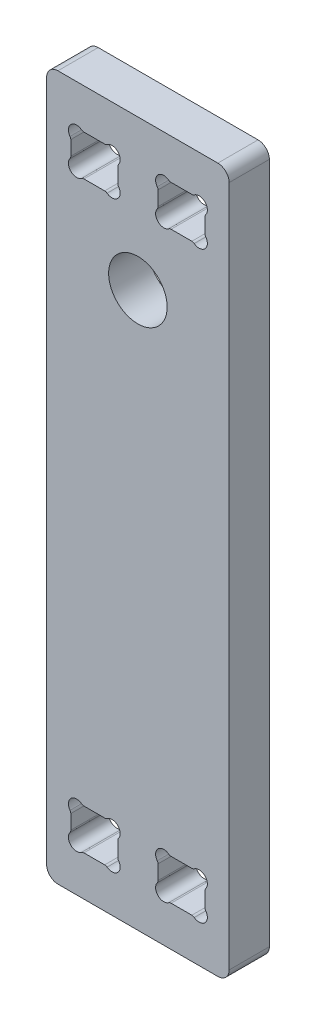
from build123d import *

# Parameters (mm, degrees)
BOSS_EXTRU_2_DEPTH = 25
CONG_1_R           = 7


with BuildPart() as part:
    # Esquisse2 → Boss.-Extru.2 (new body)
    with BuildSketch(Plane.XY):
        with BuildLine():
            Line((56.666666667, 107.428362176), (56.666666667, -218.783701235))
            Line((56.666666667, -218.783701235), (0, -218.783701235))
            Line((0, -218.783701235), (0, 218.783701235))
            Line((0, 218.783701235), (56.666666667, 218.783701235))
            Line((56.666666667, 218.783701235), (56.666666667, 143.783701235))
            ThreePointArc((56.666666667, 143.783701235), (38.488997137, 125.606031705), (56.666666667, 107.428362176))
        make_face()
        with BuildLine():
            Line((36.035626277, -193.883701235), (23.131040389, -193.883701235))
            ThreePointArc((23.131040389, -193.883701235), (22.347325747, -194.009719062), (21.642620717, -194.375068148))
            ThreePointArc((21.642620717, -194.375068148), (15, -193.883701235), (14.508633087, -187.241080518))
            ThreePointArc((14.508633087, -187.241080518), (14.873982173, -186.536375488), (15, -185.752660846))
            Line((15, -185.752660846), (15, -176.814741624))
            ThreePointArc((15, -176.814741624), (14.873982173, -176.031026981), (14.508633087, -175.326321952))
            ThreePointArc((14.508633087, -175.326321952), (15, -168.683701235), (21.642620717, -168.192334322))
            ThreePointArc((21.642620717, -168.192334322), (22.347325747, -168.557683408), (23.131040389, -168.683701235))
            Line((23.131040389, -168.683701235), (36.035626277, -168.683701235))
            ThreePointArc((36.035626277, -168.683701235), (36.81934092, -168.557683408), (37.52404595, -168.192334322))
            ThreePointArc((37.52404595, -168.192334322), (44.166666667, -168.683701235), (44.65803358, -175.326321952))
            ThreePointArc((44.65803358, -175.326321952), (44.292684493, -176.031026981), (44.166666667, -176.814741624))
            Line((44.166666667, -176.814741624), (44.166666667, -185.752660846))
            ThreePointArc((44.166666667, -185.752660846), (44.292684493, -186.536375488), (44.65803358, -187.241080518))
            ThreePointArc((44.65803358, -187.241080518), (44.166666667, -193.883701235), (37.52404595, -194.375068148))
            ThreePointArc((37.52404595, -194.375068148), (36.81934092, -194.009719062), (36.035626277, -193.883701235))
        make_face(mode=Mode.SUBTRACT)
        with BuildLine():
            Line((44.166666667, 176.814741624), (44.166666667, 185.752660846))
            ThreePointArc((44.166666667, 185.752660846), (44.292684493, 186.536375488), (44.65803358, 187.241080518))
            ThreePointArc((44.65803358, 187.241080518), (44.166666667, 193.883701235), (37.52404595, 194.375068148))
            ThreePointArc((37.52404595, 194.375068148), (36.81934092, 194.009719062), (36.035626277, 193.883701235))
            Line((36.035626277, 193.883701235), (23.131040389, 193.883701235))
            ThreePointArc((23.131040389, 193.883701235), (22.347325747, 194.009719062), (21.642620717, 194.375068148))
            ThreePointArc((21.642620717, 194.375068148), (15, 193.883701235), (14.508633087, 187.241080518))
            ThreePointArc((14.508633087, 187.241080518), (14.873982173, 186.536375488), (15, 185.752660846))
            Line((15, 185.752660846), (15, 176.814741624))
            ThreePointArc((15, 176.814741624), (14.873982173, 176.031026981), (14.508633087, 175.326321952))
            ThreePointArc((14.508633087, 175.326321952), (15, 168.683701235), (21.642620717, 168.192334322))
            ThreePointArc((21.642620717, 168.192334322), (22.347325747, 168.557683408), (23.131040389, 168.683701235))
            Line((23.131040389, 168.683701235), (36.035626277, 168.683701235))
            ThreePointArc((36.035626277, 168.683701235), (36.81934092, 168.557683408), (37.52404595, 168.192334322))
            ThreePointArc((37.52404595, 168.192334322), (44.166666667, 168.683701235), (44.65803358, 175.326321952))
            ThreePointArc((44.65803358, 175.326321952), (44.292684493, 176.031026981), (44.166666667, 176.814741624))
        make_face(mode=Mode.SUBTRACT)
    extrude(amount=BOSS_EXTRU_2_DEPTH)

    # Cong_1
    cong_1_edges = [part.edges().sort_by_distance(p)[0] for p in [
        (0, 218.783701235, 12.5),
        (0, -218.783701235, 12.5),
    ]]
    fillet(cong_1_edges, radius=CONG_1_R)

    # Mirror1: part across plane


with BuildPart() as part_1:
    add(part.part)
    add(part.part.mirror(Plane(origin=(56.666666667, 107.428362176, 25), x_dir=(0, 0, 1), z_dir=(-1, 0, 0))))


solid = part_1.part
